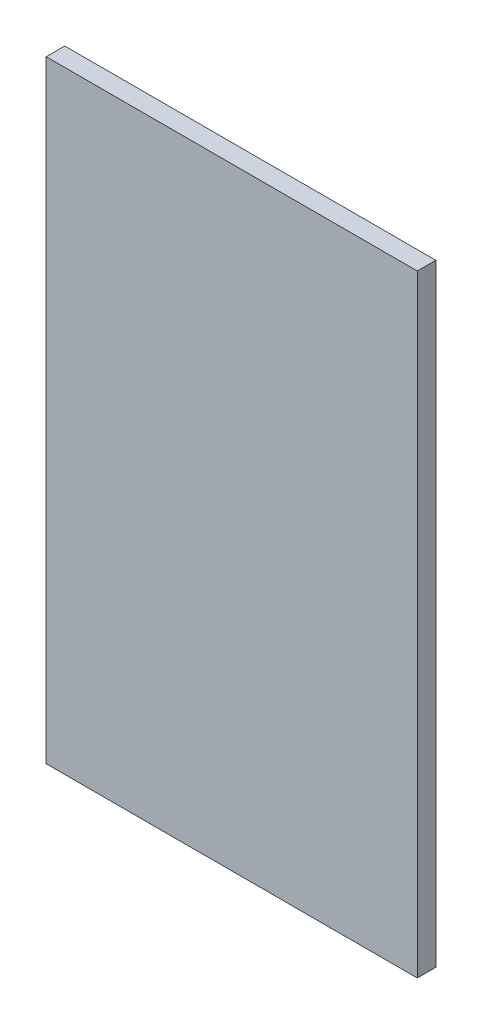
from build123d import *

# Parameters (mm, degrees)
SKETCH_3_W      = 20
SKETCH_3_H      = 33
EXTRUDE_1_DEPTH = 1


with BuildPart() as part:
    # Sketch 3 → Extrude 1 (new body)
    with BuildSketch(Plane.XY):
        with Locations((-9.551369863, 2.712328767)):
            Rectangle(SKETCH_3_W, SKETCH_3_H)
    extrude(amount=EXTRUDE_1_DEPTH)


solid = part.part
